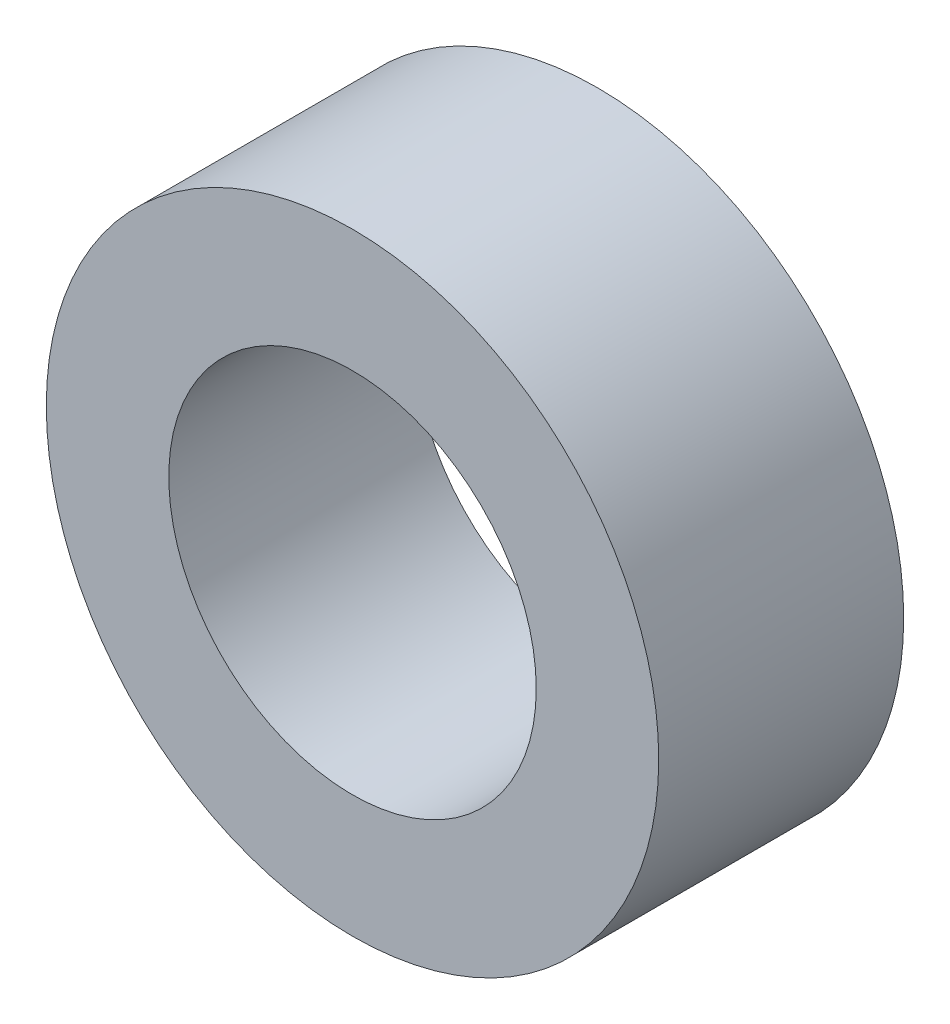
from build123d import *

# Parameters (mm, degrees)
SKETCH1_R           = 7.9375
SKETCH1_R_2         = 4.7625
BOSS_EXTRUDE1_DEPTH = 6.35


with BuildPart() as part:
    # Sketch1 → Boss-Extrude1 (new body)
    with BuildSketch(Plane.XY):
        Circle(SKETCH1_R)
        Circle(SKETCH1_R_2, mode=Mode.SUBTRACT)
    extrude(amount=BOSS_EXTRUDE1_DEPTH)


solid = part.part
